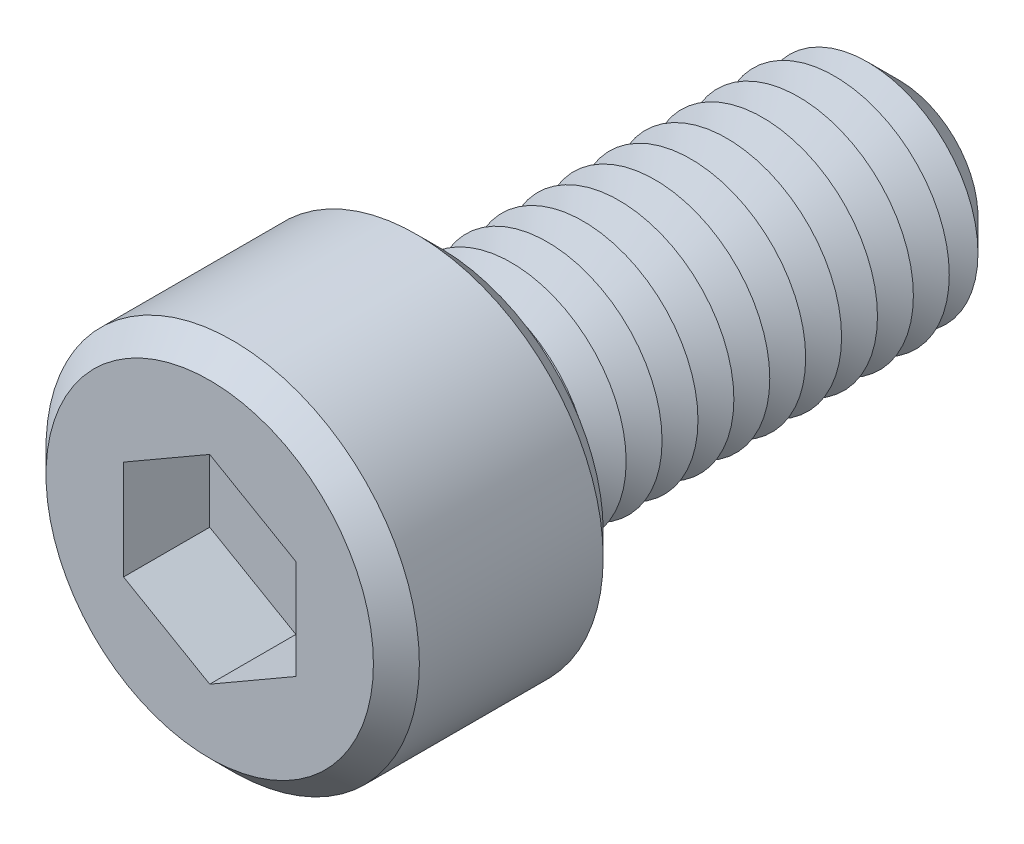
from build123d import *

# Parameters (mm, degrees)
SKETCH1_R           = 6.5
BOSS_EXTRUDE1_DEPTH = 8
SKETCH2_R           = 4
BOSS_EXTRUDE2_DEPTH = 16
CHAMFER1_SIZE       = 1.25
LPATTERN1_COUNT     = 12
LPATTERN1_PITCH     = 1.25
CUT_EXTRUDE1_DEPTH  = 3
SKETCH6_R           = 0.9
CUT_EXTRUDE2_DEPTH  = 21
CHAMFER2_SIZE       = 0.8


with BuildPart() as part:
    # Sketch1 → Boss-Extrude1 (new body)
    with BuildSketch(Plane.XY):
        Circle(SKETCH1_R)
    extrude(amount=BOSS_EXTRUDE1_DEPTH)

    # Sketch2 → Boss-Extrude2 (add)
    with BuildSketch(Plane(origin=(0, 0, 0), x_dir=(-1, 0, 0), z_dir=(0, 0, -1))):
        Circle(SKETCH2_R)
    extrude(amount=BOSS_EXTRUDE2_DEPTH)

    # Chamfer1
    chamfer1_edges = [part.edges().sort_by_distance(p)[0] for p in [
        (4, 0, -16),
    ]]
    chamfer(chamfer1_edges, length=CHAMFER1_SIZE)

    # Sketch4 → Cut-Revolve1 (revolve, cut)
    with BuildSketch(Plane(origin=(0, 0, 0), x_dir=(0, 0, -1), z_dir=(1, 0, 0)), mode=Mode.PRIVATE) as cut_revolve1_sk:
        Polygon((0, 4), (0.625, 2.917468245), (1.25, 4), align=None)
    cut_revolve1 = revolve(cut_revolve1_sk.sketch.rotate(Axis((0, 0, 2.512122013), (0, 0, -1)), 90), axis=Axis((0, 0, 2.512122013), (0, 0, -1)), mode=Mode.SUBTRACT)

    # LPattern1: Cut-Revolve1 ×12
    with Locations(*[(0, 0, -i * LPATTERN1_PITCH) for i in range(1, LPATTERN1_COUNT)]):
        add(cut_revolve1, mode=Mode.SUBTRACT)

    # Sketch5 → Cut-Extrude1 (cut)
    with BuildSketch(Plane.XY.offset(8)):
        Polygon((0, 3.464101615), (-3, 1.732050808), (-3, -1.732050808), (0, -3.464101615), (3, -1.732050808), (3, 1.732050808), align=None)
    extrude(amount=-CUT_EXTRUDE1_DEPTH, mode=Mode.SUBTRACT)

    # Sketch6 → Cut-Extrude2 (cut)
    with BuildSketch(Plane.XY.offset(5)):
        Circle(SKETCH6_R)
    extrude(amount=-CUT_EXTRUDE2_DEPTH, mode=Mode.SUBTRACT)

    # Chamfer2
    chamfer2_edges = [part.edges().sort_by_distance(p)[0] for p in [
        (-6.5, 0, 0),
        (-6.5, 0, 8),
    ]]
    chamfer(chamfer2_edges, length=CHAMFER2_SIZE)


solid = part.part
